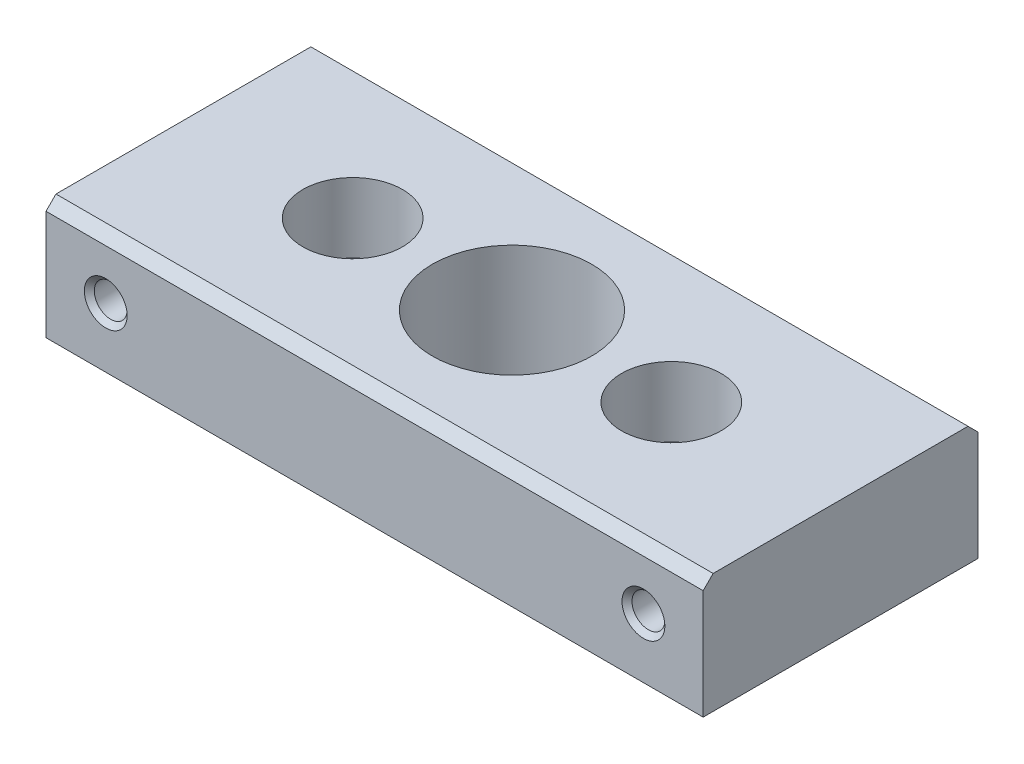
ISO-10303-21;
HEADER;
FILE_DESCRIPTION(('STEP AP214'),'2;1');
FILE_NAME('part.step','',(''),(''),'','','');
FILE_SCHEMA(('AUTOMOTIVE_DESIGN { 1 0 10303 214 1 1 1 1 }'));
ENDSEC;
DATA;
#1=APPLICATION_CONTEXT('core data for automotive mechanical design processes');
#2=APPLICATION_PROTOCOL_DEFINITION('international standard','automotive_design',2000,#1);
#3=PRODUCT_CONTEXT('',#1,'mechanical');
#4=PRODUCT('Part','Part','',(#3));
#5=PRODUCT_RELATED_PRODUCT_CATEGORY('part','',(#4));
#6=PRODUCT_DEFINITION_FORMATION('','',#4);
#7=PRODUCT_DEFINITION_CONTEXT('part definition',#1,'design');
#8=PRODUCT_DEFINITION('design','',#6,#7);
#9=PRODUCT_DEFINITION_SHAPE('','',#8);
#10=(LENGTH_UNIT() NAMED_UNIT(*) SI_UNIT(.MILLI.,.METRE.));
#11=(NAMED_UNIT(*) PLANE_ANGLE_UNIT() SI_UNIT($,.RADIAN.));
#12=(NAMED_UNIT(*) SI_UNIT($,.STERADIAN.) SOLID_ANGLE_UNIT());
#13=UNCERTAINTY_MEASURE_WITH_UNIT(LENGTH_MEASURE(1.E-05),#10,'distance_accuracy_value','');
#14=(GEOMETRIC_REPRESENTATION_CONTEXT(3) GLOBAL_UNCERTAINTY_ASSIGNED_CONTEXT((#13)) GLOBAL_UNIT_ASSIGNED_CONTEXT((#10,
#11,#12)) REPRESENTATION_CONTEXT('',''));
#15=CARTESIAN_POINT('',(0.,0.,0.));
#16=DIRECTION('',(0.,0.,1.));
#17=DIRECTION('',(1.,0.,0.));
#18=AXIS2_PLACEMENT_3D('',#15,#16,#17);
#19=CARTESIAN_POINT('',(16.0000000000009,-9.99200722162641E-13,-13.8000000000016));
#20=DIRECTION('',(0.,0.999999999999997,0.));
#21=DIRECTION('',(-1.,0.,0.));
#22=AXIS2_PLACEMENT_3D('',#19,#20,#21);
#23=CYLINDRICAL_SURFACE('',#22,3.);
#24=CARTESIAN_POINT('',(16.0000000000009,-9.99200722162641E-13,-13.8000000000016));
#25=DIRECTION('',(0.,0.999999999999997,0.));
#26=DIRECTION('',(-1.,0.,0.));
#27=AXIS2_PLACEMENT_3D('',#24,#25,#26);
#28=CIRCLE('',#27,3.);
#29=CARTESIAN_POINT('',(13.0000000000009,-9.99866855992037E-13,-13.8000000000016));
#30=VERTEX_POINT('',#29);
#31=EDGE_CURVE('E136',#30,#30,#28,.T.);
#32=CARTESIAN_POINT('',(16.0000000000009,4.99999999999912,-13.8000000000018));
#33=DIRECTION('',(0.,0.999999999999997,0.));
#34=DIRECTION('',(-1.,0.,0.));
#35=AXIS2_PLACEMENT_3D('',#32,#33,#34);
#36=CIRCLE('',#35,3.);
#37=CARTESIAN_POINT('',(13.0000000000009,4.99999999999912,-13.8000000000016));
#38=VERTEX_POINT('',#37);
#39=EDGE_CURVE('E138',#38,#38,#36,.F.);
#40=CARTESIAN_POINT('',(13.0000000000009,-9.99866855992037E-13,-13.8000000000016));
#41=CARTESIAN_POINT('',(13.0000000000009,0.0520833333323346,-13.8000000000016));
#42=CARTESIAN_POINT('',(13.0000000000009,0.104166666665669,-13.8000000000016));
#43=CARTESIAN_POINT('',(13.0000000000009,0.208333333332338,-13.8000000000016));
#44=CARTESIAN_POINT('',(13.0000000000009,0.260416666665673,-13.8000000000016));
#45=CARTESIAN_POINT('',(13.0000000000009,0.364583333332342,-13.8000000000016));
#46=CARTESIAN_POINT('',(13.0000000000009,0.416666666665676,-13.8000000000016));
#47=CARTESIAN_POINT('',(13.0000000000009,0.520833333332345,-13.8000000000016));
#48=CARTESIAN_POINT('',(13.0000000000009,0.57291666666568,-13.8000000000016));
#49=CARTESIAN_POINT('',(13.0000000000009,0.677083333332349,-13.8000000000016));
#50=CARTESIAN_POINT('',(13.0000000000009,0.729166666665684,-13.8000000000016));
#51=CARTESIAN_POINT('',(13.0000000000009,0.833333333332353,-13.8000000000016));
#52=CARTESIAN_POINT('',(13.0000000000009,0.885416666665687,-13.8000000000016));
#53=CARTESIAN_POINT('',(13.0000000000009,0.989583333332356,-13.8000000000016));
#54=CARTESIAN_POINT('',(13.0000000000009,1.04166666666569,-13.8000000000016));
#55=CARTESIAN_POINT('',(13.0000000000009,1.14583333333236,-13.8000000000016));
#56=CARTESIAN_POINT('',(13.0000000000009,1.19791666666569,-13.8000000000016));
#57=CARTESIAN_POINT('',(13.0000000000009,1.30208333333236,-13.8000000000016));
#58=CARTESIAN_POINT('',(13.0000000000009,1.3541666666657,-13.8000000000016));
#59=CARTESIAN_POINT('',(13.0000000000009,1.45833333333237,-13.8000000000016));
#60=CARTESIAN_POINT('',(13.0000000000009,1.5104166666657,-13.8000000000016));
#61=CARTESIAN_POINT('',(13.0000000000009,1.61458333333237,-13.8000000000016));
#62=CARTESIAN_POINT('',(13.0000000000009,1.66666666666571,-13.8000000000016));
#63=CARTESIAN_POINT('',(13.0000000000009,1.77083333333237,-13.8000000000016));
#64=CARTESIAN_POINT('',(13.0000000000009,1.82291666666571,-13.8000000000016));
#65=CARTESIAN_POINT('',(13.0000000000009,1.92708333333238,-13.8000000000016));
#66=CARTESIAN_POINT('',(13.0000000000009,1.97916666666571,-13.8000000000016));
#67=CARTESIAN_POINT('',(13.0000000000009,2.08333333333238,-13.8000000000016));
#68=CARTESIAN_POINT('',(13.0000000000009,2.13541666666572,-13.8000000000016));
#69=CARTESIAN_POINT('',(13.0000000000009,2.23958333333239,-13.8000000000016));
#70=CARTESIAN_POINT('',(13.0000000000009,2.29166666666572,-13.8000000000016));
#71=CARTESIAN_POINT('',(13.0000000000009,2.39583333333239,-13.8000000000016));
#72=CARTESIAN_POINT('',(13.0000000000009,2.44791666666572,-13.8000000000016));
#73=CARTESIAN_POINT('',(13.0000000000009,2.55208333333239,-13.8000000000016));
#74=CARTESIAN_POINT('',(13.0000000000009,2.60416666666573,-13.8000000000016));
#75=CARTESIAN_POINT('',(13.0000000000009,2.7083333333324,-13.8000000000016));
#76=CARTESIAN_POINT('',(13.0000000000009,2.76041666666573,-13.8000000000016));
#77=CARTESIAN_POINT('',(13.0000000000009,2.8645833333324,-13.8000000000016));
#78=CARTESIAN_POINT('',(13.0000000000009,2.91666666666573,-13.8000000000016));
#79=CARTESIAN_POINT('',(13.0000000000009,3.0208333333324,-13.8000000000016));
#80=CARTESIAN_POINT('',(13.0000000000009,3.07291666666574,-13.8000000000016));
#81=CARTESIAN_POINT('',(13.0000000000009,3.17708333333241,-13.8000000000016));
#82=CARTESIAN_POINT('',(13.0000000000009,3.22916666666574,-13.8000000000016));
#83=CARTESIAN_POINT('',(13.0000000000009,3.33333333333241,-13.8000000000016));
#84=CARTESIAN_POINT('',(13.0000000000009,3.38541666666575,-13.8000000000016));
#85=CARTESIAN_POINT('',(13.0000000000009,3.48958333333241,-13.8000000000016));
#86=CARTESIAN_POINT('',(13.0000000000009,3.54166666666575,-13.8000000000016));
#87=CARTESIAN_POINT('',(13.0000000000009,3.64583333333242,-13.8000000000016));
#88=CARTESIAN_POINT('',(13.0000000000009,3.69791666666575,-13.8000000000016));
#89=CARTESIAN_POINT('',(13.0000000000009,3.80208333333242,-13.8000000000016));
#90=CARTESIAN_POINT('',(13.0000000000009,3.85416666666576,-13.8000000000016));
#91=CARTESIAN_POINT('',(13.0000000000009,3.95833333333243,-13.8000000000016));
#92=CARTESIAN_POINT('',(13.0000000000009,4.01041666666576,-13.8000000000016));
#93=CARTESIAN_POINT('',(13.0000000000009,4.11458333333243,-13.8000000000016));
#94=CARTESIAN_POINT('',(13.0000000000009,4.16666666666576,-13.8000000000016));
#95=CARTESIAN_POINT('',(13.0000000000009,4.27083333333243,-13.8000000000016));
#96=CARTESIAN_POINT('',(13.0000000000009,4.32291666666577,-13.8000000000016));
#97=CARTESIAN_POINT('',(13.0000000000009,4.42708333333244,-13.8000000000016));
#98=CARTESIAN_POINT('',(13.0000000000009,4.47916666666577,-13.8000000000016));
#99=CARTESIAN_POINT('',(13.0000000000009,4.58333333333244,-13.8000000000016));
#100=CARTESIAN_POINT('',(13.0000000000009,4.63541666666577,-13.8000000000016));
#101=CARTESIAN_POINT('',(13.0000000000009,4.73958333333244,-13.8000000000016));
#102=CARTESIAN_POINT('',(13.0000000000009,4.79166666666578,-13.8000000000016));
#103=CARTESIAN_POINT('',(13.0000000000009,4.89583333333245,-13.8000000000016));
#104=CARTESIAN_POINT('',(13.0000000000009,4.94791666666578,-13.8000000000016));
#105=CARTESIAN_POINT('',(13.0000000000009,4.99999999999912,-13.8000000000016));
#106=B_SPLINE_CURVE_WITH_KNOTS('',3,(#40,#41,#42,#43,#44,#45,#46,#47,#48,#49,#50,#51,#52,#53,
#54,#55,#56,#57,#58,#59,#60,#61,#62,#63,#64,#65,#66,#67,#68,#69,#70,#71,#72,#73,#74,#75,#76,#77,
#78,#79,#80,#81,#82,#83,#84,#85,#86,#87,#88,#89,#90,#91,#92,#93,#94,#95,#96,#97,#98,#99,#100,
#101,#102,#103,#104,#105),.UNSPECIFIED.,.F.,.F.,(4,2,2,2,2,2,2,2,2,2,2,2,2,2,2,2,2,2,2,2,2,2,2,
2,2,2,2,2,2,2,2,2,4),(0.,0.156250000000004,0.312500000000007,0.468750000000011,
0.625000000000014,0.781250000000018,0.937500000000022,1.09375000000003,1.25000000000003,
1.40625000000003,1.56250000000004,1.71875000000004,1.87500000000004,2.03125000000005,
2.18750000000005,2.34375000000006,2.50000000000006,2.65625000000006,2.81250000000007,
2.96875000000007,3.12500000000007,3.28125000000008,3.43750000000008,3.59375000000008,
3.75000000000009,3.90625000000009,4.06250000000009,4.2187500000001,4.3750000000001,
4.5312500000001,4.68750000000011,4.84375000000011,5.00000000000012),.UNSPECIFIED.);
#107=EDGE_CURVE('BSEAM40',#30,#38,#106,.T.);
#108=ORIENTED_EDGE('',*,*,#31,.F.);
#109=ORIENTED_EDGE('',*,*,#39,.F.);
#110=ORIENTED_EDGE('',*,*,#107,.T.);
#111=ORIENTED_EDGE('',*,*,#107,.F.);
#112=EDGE_LOOP('',(#108,#110,#109,#111));
#113=FACE_BOUND('',#112,.T.);
#114=ADVANCED_FACE('F40',(#113),#23,.F.);
#115=CARTESIAN_POINT('',(-16.,0.,-13.8));
#116=DIRECTION('',(0.,0.999999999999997,0.));
#117=DIRECTION('',(-1.,0.,0.));
#118=AXIS2_PLACEMENT_3D('',#115,#116,#117);
#119=CYLINDRICAL_SURFACE('',#118,3.);
#120=CARTESIAN_POINT('',(-16.,0.,-13.8));
#121=DIRECTION('',(0.,0.999999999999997,0.));
#122=DIRECTION('',(-1.,0.,0.));
#123=AXIS2_PLACEMENT_3D('',#120,#121,#122);
#124=CIRCLE('',#123,3.);
#125=CARTESIAN_POINT('',(-19.,0.,-13.8));
#126=VERTEX_POINT('',#125);
#127=EDGE_CURVE('E285',#126,#126,#124,.T.);
#128=CARTESIAN_POINT('',(-16.,4.99999999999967,-13.800000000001));
#129=DIRECTION('',(0.,0.999999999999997,0.));
#130=DIRECTION('',(-1.,0.,0.));
#131=AXIS2_PLACEMENT_3D('',#128,#129,#130);
#132=CIRCLE('',#131,3.);
#133=CARTESIAN_POINT('',(-19.,4.99999999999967,-13.8));
#134=VERTEX_POINT('',#133);
#135=EDGE_CURVE('E133',#134,#134,#132,.F.);
#136=CARTESIAN_POINT('',(-19.,0.,-13.8));
#137=CARTESIAN_POINT('',(-19.,0.0520833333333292,-13.8));
#138=CARTESIAN_POINT('',(-19.,0.104166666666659,-13.8));
#139=CARTESIAN_POINT('',(-19.,0.208333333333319,-13.8));
#140=CARTESIAN_POINT('',(-19.,0.260416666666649,-13.8));
#141=CARTESIAN_POINT('',(-19.,0.364583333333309,-13.8));
#142=CARTESIAN_POINT('',(-19.,0.416666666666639,-13.8));
#143=CARTESIAN_POINT('',(-19.,0.520833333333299,-13.8));
#144=CARTESIAN_POINT('',(-19.,0.572916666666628,-13.8));
#145=CARTESIAN_POINT('',(-19.,0.677083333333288,-13.8));
#146=CARTESIAN_POINT('',(-19.,0.729166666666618,-13.8));
#147=CARTESIAN_POINT('',(-19.,0.833333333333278,-13.8));
#148=CARTESIAN_POINT('',(-19.,0.885416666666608,-13.8));
#149=CARTESIAN_POINT('',(-19.,0.989583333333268,-13.8));
#150=CARTESIAN_POINT('',(-19.,1.0416666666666,-13.8));
#151=CARTESIAN_POINT('',(-19.,1.14583333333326,-13.8));
#152=CARTESIAN_POINT('',(-19.,1.19791666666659,-13.8));
#153=CARTESIAN_POINT('',(-19.,1.30208333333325,-13.8));
#154=CARTESIAN_POINT('',(-19.,1.35416666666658,-13.8));
#155=CARTESIAN_POINT('',(-19.,1.45833333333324,-13.8));
#156=CARTESIAN_POINT('',(-19.,1.51041666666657,-13.8));
#157=CARTESIAN_POINT('',(-19.,1.61458333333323,-13.8));
#158=CARTESIAN_POINT('',(-19.,1.66666666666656,-13.8));
#159=CARTESIAN_POINT('',(-19.,1.77083333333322,-13.8));
#160=CARTESIAN_POINT('',(-19.,1.82291666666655,-13.8));
#161=CARTESIAN_POINT('',(-19.,1.92708333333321,-13.8));
#162=CARTESIAN_POINT('',(-19.,1.97916666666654,-13.8));
#163=CARTESIAN_POINT('',(-19.,2.0833333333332,-13.8));
#164=CARTESIAN_POINT('',(-19.,2.13541666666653,-13.8));
#165=CARTESIAN_POINT('',(-19.,2.23958333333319,-13.8));
#166=CARTESIAN_POINT('',(-19.,2.29166666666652,-13.8));
#167=CARTESIAN_POINT('',(-19.,2.39583333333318,-13.8));
#168=CARTESIAN_POINT('',(-19.,2.44791666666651,-13.8));
#169=CARTESIAN_POINT('',(-19.,2.55208333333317,-13.8));
#170=CARTESIAN_POINT('',(-19.,2.6041666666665,-13.8));
#171=CARTESIAN_POINT('',(-19.,2.70833333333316,-13.8));
#172=CARTESIAN_POINT('',(-19.,2.76041666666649,-13.8));
#173=CARTESIAN_POINT('',(-19.,2.86458333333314,-13.8));
#174=CARTESIAN_POINT('',(-19.,2.91666666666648,-13.8));
#175=CARTESIAN_POINT('',(-19.,3.02083333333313,-13.8));
#176=CARTESIAN_POINT('',(-19.,3.07291666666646,-13.8));
#177=CARTESIAN_POINT('',(-19.,3.17708333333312,-13.8));
#178=CARTESIAN_POINT('',(-19.,3.22916666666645,-13.8));
#179=CARTESIAN_POINT('',(-19.,3.33333333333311,-13.8));
#180=CARTESIAN_POINT('',(-19.,3.38541666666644,-13.8));
#181=CARTESIAN_POINT('',(-19.,3.4895833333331,-13.8));
#182=CARTESIAN_POINT('',(-19.,3.54166666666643,-13.8));
#183=CARTESIAN_POINT('',(-19.,3.64583333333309,-13.8));
#184=CARTESIAN_POINT('',(-19.,3.69791666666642,-13.8));
#185=CARTESIAN_POINT('',(-19.,3.80208333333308,-13.8));
#186=CARTESIAN_POINT('',(-19.,3.85416666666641,-13.8));
#187=CARTESIAN_POINT('',(-19.,3.95833333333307,-13.8));
#188=CARTESIAN_POINT('',(-19.,4.0104166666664,-13.8));
#189=CARTESIAN_POINT('',(-19.,4.11458333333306,-13.8));
#190=CARTESIAN_POINT('',(-19.,4.16666666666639,-13.8));
#191=CARTESIAN_POINT('',(-19.,4.27083333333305,-13.8));
#192=CARTESIAN_POINT('',(-19.,4.32291666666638,-13.8));
#193=CARTESIAN_POINT('',(-19.,4.42708333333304,-13.8));
#194=CARTESIAN_POINT('',(-19.,4.47916666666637,-13.8));
#195=CARTESIAN_POINT('',(-19.,4.58333333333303,-13.8));
#196=CARTESIAN_POINT('',(-19.,4.63541666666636,-13.8));
#197=CARTESIAN_POINT('',(-19.,4.73958333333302,-13.8));
#198=CARTESIAN_POINT('',(-19.,4.79166666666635,-13.8));
#199=CARTESIAN_POINT('',(-19.,4.89583333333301,-13.8));
#200=CARTESIAN_POINT('',(-19.,4.94791666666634,-13.8));
#201=CARTESIAN_POINT('',(-19.,4.99999999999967,-13.8));
#202=B_SPLINE_CURVE_WITH_KNOTS('',3,(#136,#137,#138,#139,#140,#141,#142,#143,#144,#145,#146,
#147,#148,#149,#150,#151,#152,#153,#154,#155,#156,#157,#158,#159,#160,#161,#162,#163,#164,#165,
#166,#167,#168,#169,#170,#171,#172,#173,#174,#175,#176,#177,#178,#179,#180,#181,#182,#183,#184,
#185,#186,#187,#188,#189,#190,#191,#192,#193,#194,#195,#196,#197,#198,#199,#200,#201),
.UNSPECIFIED.,.F.,.F.,(4,2,2,2,2,2,2,2,2,2,2,2,2,2,2,2,2,2,2,2,2,2,2,2,2,2,2,2,2,2,2,2,4),(0.,
0.15624999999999,0.31249999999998,0.468749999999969,0.624999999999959,0.781249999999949,
0.937499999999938,1.09374999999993,1.24999999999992,1.40624999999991,1.5624999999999,
1.71874999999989,1.87499999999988,2.03124999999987,2.18749999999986,2.34374999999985,
2.49999999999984,2.65624999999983,2.81249999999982,2.96874999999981,3.1249999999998,
3.28124999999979,3.43749999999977,3.59374999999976,3.74999999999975,3.90624999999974,
4.06249999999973,4.21874999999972,4.37499999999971,4.5312499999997,4.68749999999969,
4.84374999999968,4.99999999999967),.UNSPECIFIED.);
#203=EDGE_CURVE('BSEAM195',#126,#134,#202,.T.);
#204=ORIENTED_EDGE('',*,*,#127,.F.);
#205=ORIENTED_EDGE('',*,*,#135,.F.);
#206=ORIENTED_EDGE('',*,*,#203,.T.);
#207=ORIENTED_EDGE('',*,*,#203,.F.);
#208=EDGE_LOOP('',(#204,#206,#205,#207));
#209=FACE_BOUND('',#208,.T.);
#210=ADVANCED_FACE('F195',(#209),#119,.F.);
#211=CARTESIAN_POINT('',(-32.9999999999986,0.,-27.6000000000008));
#212=DIRECTION('',(-1.,0.,0.));
#213=DIRECTION('',(0.,0.,1.));
#214=AXIS2_PLACEMENT_3D('',#211,#212,#213);
#215=PLANE('',#214);
#216=DIRECTION('',(0.,0.,1.));
#217=VECTOR('',#216,1.);
#218=CARTESIAN_POINT('',(-32.9999999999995,11.9999999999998,-27.6000000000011));
#219=LINE('',#218,#217);
#220=CARTESIAN_POINT('',(-32.9999999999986,11.9999999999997,-26.6000000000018));
#221=VERTEX_POINT('',#220);
#222=CARTESIAN_POINT('',(-33.0000000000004,11.9999999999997,-1.00000000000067));
#223=VERTEX_POINT('',#222);
#224=EDGE_CURVE('E126',#221,#223,#219,.T.);
#225=ORIENTED_EDGE('',*,*,#224,.F.);
#226=DIRECTION('',(0.,0.707106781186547,0.707106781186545));
#227=VECTOR('',#226,1.);
#228=CARTESIAN_POINT('',(-33.0000000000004,5.49999999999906,-33.1000000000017));
#229=LINE('',#228,#227);
#230=CARTESIAN_POINT('',(-32.9999999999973,10.9999999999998,-27.6000000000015));
#231=VERTEX_POINT('',#230);
#232=EDGE_CURVE('E103',#221,#231,#229,.F.);
#233=ORIENTED_EDGE('',*,*,#232,.T.);
#234=DIRECTION('',(0.,-0.999999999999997,0.));
#235=VECTOR('',#234,1.);
#236=CARTESIAN_POINT('',(-32.9999999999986,0.,-27.6000000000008));
#237=LINE('',#236,#235);
#238=CARTESIAN_POINT('',(-32.9999999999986,0.,-27.6000000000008));
#239=VERTEX_POINT('',#238);
#240=EDGE_CURVE('E96',#231,#239,#237,.T.);
#241=ORIENTED_EDGE('',*,*,#240,.T.);
#242=DIRECTION('',(0.,0.,1.));
#243=VECTOR('',#242,1.);
#244=CARTESIAN_POINT('',(-32.9999999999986,0.,-27.6000000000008));
#245=LINE('',#244,#243);
#246=CARTESIAN_POINT('',(-32.9999999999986,4.44089209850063E-13,-2.1094237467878E-12));
#247=VERTEX_POINT('',#246);
#248=EDGE_CURVE('E101',#239,#247,#245,.T.);
#249=ORIENTED_EDGE('',*,*,#248,.T.);
#250=DIRECTION('',(0.,-0.999999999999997,0.));
#251=VECTOR('',#250,1.);
#252=CARTESIAN_POINT('',(-32.9999999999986,4.44089209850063E-13,-2.1094237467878E-12));
#253=LINE('',#252,#251);
#254=CARTESIAN_POINT('',(-32.9999999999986,11.,-1.66533453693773E-12));
#255=VERTEX_POINT('',#254);
#256=EDGE_CURVE('E121',#255,#247,#253,.T.);
#257=ORIENTED_EDGE('',*,*,#256,.F.);
#258=DIRECTION('',(0.,0.707106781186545,-0.707106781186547));
#259=VECTOR('',#258,1.);
#260=CARTESIAN_POINT('',(-32.9999999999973,19.2999999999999,-8.30000000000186));
#261=LINE('',#260,#259);
#262=EDGE_CURVE('E171',#255,#223,#261,.T.);
#263=ORIENTED_EDGE('',*,*,#262,.T.);
#264=EDGE_LOOP('',(#225,#233,#241,#249,#257,#263));
#265=FACE_BOUND('',#264,.T.);
#266=ADVANCED_FACE('F99',(#265),#215,.T.);
#267=CARTESIAN_POINT('',(-32.9999999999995,11.9999999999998,-27.6000000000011));
#268=DIRECTION('',(0.,0.999999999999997,0.));
#269=DIRECTION('',(-1.,0.,0.));
#270=AXIS2_PLACEMENT_3D('',#267,#268,#269);
#271=PLANE('',#270);
#272=CARTESIAN_POINT('',(16.0000000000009,11.9999999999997,-13.8000000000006));
#273=DIRECTION('',(0.,0.999999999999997,0.));
#274=DIRECTION('',(-1.,0.,0.));
#275=AXIS2_PLACEMENT_3D('',#272,#273,#274);
#276=CIRCLE('',#275,5.);
#277=CARTESIAN_POINT('',(11.0000000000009,11.9999999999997,-13.8000000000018));
#278=VERTEX_POINT('',#277);
#279=EDGE_CURVE('E280',#278,#278,#276,.T.);
#280=ORIENTED_EDGE('',*,*,#279,.F.);
#281=EDGE_LOOP('',(#280));
#282=FACE_BOUND('',#281,.T.);
#283=CARTESIAN_POINT('',(-15.9999999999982,12.0000000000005,-13.8000000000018));
#284=DIRECTION('',(0.,0.999999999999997,0.));
#285=DIRECTION('',(-1.,0.,0.));
#286=AXIS2_PLACEMENT_3D('',#283,#284,#285);
#287=CIRCLE('',#286,5.);
#288=CARTESIAN_POINT('',(-21.,12.0000000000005,-13.800000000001));
#289=VERTEX_POINT('',#288);
#290=EDGE_CURVE('E141',#289,#289,#287,.T.);
#291=ORIENTED_EDGE('',*,*,#290,.F.);
#292=EDGE_LOOP('',(#291));
#293=FACE_BOUND('',#292,.T.);
#294=CARTESIAN_POINT('',(8.88178419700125E-13,11.9999999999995,-13.800000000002));
#295=DIRECTION('',(0.,0.999999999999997,0.));
#296=DIRECTION('',(-1.,0.,0.));
#297=AXIS2_PLACEMENT_3D('',#294,#295,#296);
#298=CIRCLE('',#297,8.);
#299=CARTESIAN_POINT('',(-8.00000000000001,11.9999999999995,-13.8000000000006));
#300=VERTEX_POINT('',#299);
#301=EDGE_CURVE('E288',#300,#300,#298,.T.);
#302=ORIENTED_EDGE('',*,*,#301,.F.);
#303=EDGE_LOOP('',(#302));
#304=FACE_BOUND('',#303,.T.);
#305=DIRECTION('',(0.,0.,1.));
#306=VECTOR('',#305,1.);
#307=CARTESIAN_POINT('',(33.0000000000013,11.999999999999,-27.600000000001));
#308=LINE('',#307,#306);
#309=CARTESIAN_POINT('',(33.0000000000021,11.9999999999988,-26.6000000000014));
#310=VERTEX_POINT('',#309);
#311=CARTESIAN_POINT('',(33.0000000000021,11.9999999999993,-1.00000000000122));
#312=VERTEX_POINT('',#311);
#313=EDGE_CURVE('E130',#310,#312,#308,.T.);
#314=ORIENTED_EDGE('',*,*,#313,.F.);
#315=DIRECTION('',(-1.,0.,0.));
#316=VECTOR('',#315,1.);
#317=CARTESIAN_POINT('',(-32.9999999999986,11.9999999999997,-26.6000000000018));
#318=LINE('',#317,#316);
#319=EDGE_CURVE('E168',#310,#221,#318,.T.);
#320=ORIENTED_EDGE('',*,*,#319,.T.);
#321=ORIENTED_EDGE('',*,*,#224,.T.);
#322=DIRECTION('',(1.,0.,0.));
#323=VECTOR('',#322,1.);
#324=CARTESIAN_POINT('',(33.0000000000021,11.9999999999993,-1.00000000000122));
#325=LINE('',#324,#323);
#326=EDGE_CURVE('E166',#223,#312,#325,.T.);
#327=ORIENTED_EDGE('',*,*,#326,.T.);
#328=EDGE_LOOP('',(#314,#320,#321,#327));
#329=FACE_BOUND('',#328,.T.);
#330=ADVANCED_FACE('F181',(#282,#293,#304,#329),#271,.T.);
#331=CARTESIAN_POINT('',(33.0000000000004,1.11022302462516E-13,-27.600000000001));
#332=DIRECTION('',(1.,0.,0.));
#333=DIRECTION('',(0.,0.,-1.));
#334=AXIS2_PLACEMENT_3D('',#331,#332,#333);
#335=PLANE('',#334);
#336=DIRECTION('',(0.,0.999999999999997,0.));
#337=VECTOR('',#336,1.);
#338=CARTESIAN_POINT('',(33.0000000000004,1.11022302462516E-13,-27.600000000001));
#339=LINE('',#338,#337);
#340=CARTESIAN_POINT('',(33.0000000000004,1.11022302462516E-13,-27.600000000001));
#341=VERTEX_POINT('',#340);
#342=CARTESIAN_POINT('',(33.0000000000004,10.9999999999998,-27.6000000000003));
#343=VERTEX_POINT('',#342);
#344=EDGE_CURVE('E114',#341,#343,#339,.T.);
#345=ORIENTED_EDGE('',*,*,#344,.T.);
#346=DIRECTION('',(0.,-0.707106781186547,-0.707106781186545));
#347=VECTOR('',#346,1.);
#348=CARTESIAN_POINT('',(33.0000000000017,5.50000000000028,-33.100000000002));
#349=LINE('',#348,#347);
#350=EDGE_CURVE('E48',#343,#310,#349,.F.);
#351=ORIENTED_EDGE('',*,*,#350,.T.);
#352=ORIENTED_EDGE('',*,*,#313,.T.);
#353=DIRECTION('',(0.,-0.707106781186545,0.707106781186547));
#354=VECTOR('',#353,1.);
#355=CARTESIAN_POINT('',(33.0000000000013,19.2999999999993,-8.30000000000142));
#356=LINE('',#355,#354);
#357=CARTESIAN_POINT('',(33.0000000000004,10.9999999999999,-2.22044604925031E-13));
#358=VERTEX_POINT('',#357);
#359=EDGE_CURVE('E55',#312,#358,#356,.T.);
#360=ORIENTED_EDGE('',*,*,#359,.T.);
#361=DIRECTION('',(0.,0.999999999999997,0.));
#362=VECTOR('',#361,1.);
#363=CARTESIAN_POINT('',(33.0000000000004,0.,-2.22044604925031E-13));
#364=LINE('',#363,#362);
#365=CARTESIAN_POINT('',(33.0000000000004,0.,-2.22044604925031E-13));
#366=VERTEX_POINT('',#365);
#367=EDGE_CURVE('E106',#366,#358,#364,.T.);
#368=ORIENTED_EDGE('',*,*,#367,.F.);
#369=DIRECTION('',(0.,0.,1.));
#370=VECTOR('',#369,1.);
#371=CARTESIAN_POINT('',(33.0000000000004,1.11022302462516E-13,-27.600000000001));
#372=LINE('',#371,#370);
#373=EDGE_CURVE('E113',#341,#366,#372,.T.);
#374=ORIENTED_EDGE('',*,*,#373,.F.);
#375=EDGE_LOOP('',(#345,#351,#352,#360,#368,#374));
#376=FACE_BOUND('',#375,.T.);
#377=ADVANCED_FACE('F177',(#376),#335,.T.);
#378=CARTESIAN_POINT('',(-32.9999999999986,0.,-27.6000000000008));
#379=DIRECTION('',(0.,-0.999999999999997,0.));
#380=DIRECTION('',(1.,0.,0.));
#381=AXIS2_PLACEMENT_3D('',#378,#379,#380);
#382=PLANE('',#381);
#383=ORIENTED_EDGE('',*,*,#31,.T.);
#384=EDGE_LOOP('',(#383));
#385=FACE_BOUND('',#384,.T.);
#386=ORIENTED_EDGE('',*,*,#127,.T.);
#387=EDGE_LOOP('',(#386));
#388=FACE_BOUND('',#387,.T.);
#389=CARTESIAN_POINT('',(0.,-1.11022302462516E-13,-13.8000000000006));
#390=DIRECTION('',(0.,0.999999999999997,0.));
#391=DIRECTION('',(-1.,0.,0.));
#392=AXIS2_PLACEMENT_3D('',#389,#390,#391);
#393=CIRCLE('',#392,8.);
#394=CARTESIAN_POINT('',(-8.00000000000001,-1.12798659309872E-13,-13.8000000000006));
#395=VERTEX_POINT('',#394);
#396=EDGE_CURVE('E123',#395,#395,#393,.T.);
#397=ORIENTED_EDGE('',*,*,#396,.T.);
#398=EDGE_LOOP('',(#397));
#399=FACE_BOUND('',#398,.T.);
#400=DIRECTION('',(1.,0.,0.));
#401=VECTOR('',#400,1.);
#402=CARTESIAN_POINT('',(-32.9999999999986,4.44089209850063E-13,-2.1094237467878E-12));
#403=LINE('',#402,#401);
#404=EDGE_CURVE('E112',#247,#366,#403,.T.);
#405=ORIENTED_EDGE('',*,*,#404,.F.);
#406=ORIENTED_EDGE('',*,*,#248,.F.);
#407=DIRECTION('',(1.,0.,0.));
#408=VECTOR('',#407,1.);
#409=CARTESIAN_POINT('',(-32.9999999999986,0.,-27.6000000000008));
#410=LINE('',#409,#408);
#411=EDGE_CURVE('E105',#239,#341,#410,.T.);
#412=ORIENTED_EDGE('',*,*,#411,.T.);
#413=ORIENTED_EDGE('',*,*,#373,.T.);
#414=EDGE_LOOP('',(#405,#406,#412,#413));
#415=FACE_BOUND('',#414,.T.);
#416=ADVANCED_FACE('F110',(#385,#388,#399,#415),#382,.T.);
#417=CARTESIAN_POINT('',(0.,0.,-27.6000000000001));
#418=DIRECTION('',(0.,0.,-1.));
#419=DIRECTION('',(-1.,0.,0.));
#420=AXIS2_PLACEMENT_3D('',#417,#418,#419);
#421=PLANE('',#420);
#422=CARTESIAN_POINT('',(-26.9999999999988,5.99999999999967,-27.6000000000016));
#423=DIRECTION('',(0.,0.,-1.));
#424=DIRECTION('',(-1.,0.,0.));
#425=AXIS2_PLACEMENT_3D('',#422,#423,#424);
#426=CIRCLE('',#425,2.14999999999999);
#427=CARTESIAN_POINT('',(-29.1499999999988,5.99999999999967,-27.6000000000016));
#428=VERTEX_POINT('',#427);
#429=EDGE_CURVE('E163',#428,#428,#426,.F.);
#430=ORIENTED_EDGE('',*,*,#429,.T.);
#431=EDGE_LOOP('',(#430));
#432=FACE_BOUND('',#431,.T.);
#433=CARTESIAN_POINT('',(27.0000000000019,6.00000000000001,-27.6000000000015));
#434=DIRECTION('',(0.,0.,-1.));
#435=DIRECTION('',(-1.,0.,0.));
#436=AXIS2_PLACEMENT_3D('',#433,#434,#435);
#437=CIRCLE('',#436,2.14999999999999);
#438=CARTESIAN_POINT('',(24.8500000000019,6.00000000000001,-27.6000000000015));
#439=VERTEX_POINT('',#438);
#440=EDGE_CURVE('E160',#439,#439,#437,.F.);
#441=ORIENTED_EDGE('',*,*,#440,.T.);
#442=EDGE_LOOP('',(#441));
#443=FACE_BOUND('',#442,.T.);
#444=ORIENTED_EDGE('',*,*,#240,.F.);
#445=DIRECTION('',(1.,0.,0.));
#446=VECTOR('',#445,1.);
#447=CARTESIAN_POINT('',(0.,10.9999999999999,-27.6000000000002));
#448=LINE('',#447,#446);
#449=EDGE_CURVE('E63',#231,#343,#448,.T.);
#450=ORIENTED_EDGE('',*,*,#449,.T.);
#451=ORIENTED_EDGE('',*,*,#344,.F.);
#452=ORIENTED_EDGE('',*,*,#411,.F.);
#453=EDGE_LOOP('',(#444,#450,#451,#452));
#454=FACE_BOUND('',#453,.T.);
#455=ADVANCED_FACE('F116',(#432,#443,#454),#421,.T.);
#456=CARTESIAN_POINT('',(0.,0.,0.));
#457=DIRECTION('',(0.,0.,-1.));
#458=DIRECTION('',(-1.,0.,0.));
#459=AXIS2_PLACEMENT_3D('',#456,#457,#458);
#460=PLANE('',#459);
#461=CARTESIAN_POINT('',(27.0000000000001,5.99999999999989,-4.44089209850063E-13));
#462=DIRECTION('',(0.,0.,-1.));
#463=DIRECTION('',(-1.,0.,0.));
#464=AXIS2_PLACEMENT_3D('',#461,#462,#463);
#465=CIRCLE('',#464,2.15000000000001);
#466=CARTESIAN_POINT('',(24.8500000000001,5.99999999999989,-4.44685954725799E-13));
#467=VERTEX_POINT('',#466);
#468=EDGE_CURVE('E151',#467,#467,#465,.T.);
#469=ORIENTED_EDGE('',*,*,#468,.T.);
#470=EDGE_LOOP('',(#469));
#471=FACE_BOUND('',#470,.T.);
#472=CARTESIAN_POINT('',(-27.0000000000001,6.00000000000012,-5.55111512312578E-13));
#473=DIRECTION('',(0.,0.,-1.));
#474=DIRECTION('',(-1.,0.,0.));
#475=AXIS2_PLACEMENT_3D('',#472,#473,#474);
#476=CIRCLE('',#475,2.15000000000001);
#477=CARTESIAN_POINT('',(-29.1500000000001,6.00000000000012,-5.55708257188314E-13));
#478=VERTEX_POINT('',#477);
#479=EDGE_CURVE('E148',#478,#478,#476,.T.);
#480=ORIENTED_EDGE('',*,*,#479,.T.);
#481=EDGE_LOOP('',(#480));
#482=FACE_BOUND('',#481,.T.);
#483=ORIENTED_EDGE('',*,*,#367,.T.);
#484=DIRECTION('',(-1.,0.,0.));
#485=VECTOR('',#484,1.);
#486=CARTESIAN_POINT('',(-32.9999999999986,11.,-1.66533453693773E-12));
#487=LINE('',#486,#485);
#488=EDGE_CURVE('E11',#358,#255,#487,.T.);
#489=ORIENTED_EDGE('',*,*,#488,.T.);
#490=ORIENTED_EDGE('',*,*,#256,.T.);
#491=ORIENTED_EDGE('',*,*,#404,.T.);
#492=EDGE_LOOP('',(#483,#489,#490,#491));
#493=FACE_BOUND('',#492,.T.);
#494=ADVANCED_FACE('F213',(#471,#482,#493),#460,.F.);
#495=CARTESIAN_POINT('',(0.,-1.11022302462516E-13,-13.8000000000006));
#496=DIRECTION('',(0.,0.999999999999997,0.));
#497=DIRECTION('',(-1.,0.,0.));
#498=AXIS2_PLACEMENT_3D('',#495,#496,#497);
#499=CYLINDRICAL_SURFACE('',#498,8.);
#500=CARTESIAN_POINT('',(-8.00000000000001,-1.12798659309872E-13,-13.8000000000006));
#501=CARTESIAN_POINT('',(-8.00000000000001,0.124999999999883,-13.8000000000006));
#502=CARTESIAN_POINT('',(-8.00000000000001,0.249999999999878,-13.8000000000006));
#503=CARTESIAN_POINT('',(-8.00000000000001,0.499999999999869,-13.8000000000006));
#504=CARTESIAN_POINT('',(-8.00000000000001,0.624999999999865,-13.8000000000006));
#505=CARTESIAN_POINT('',(-8.00000000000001,0.874999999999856,-13.8000000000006));
#506=CARTESIAN_POINT('',(-8.00000000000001,0.999999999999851,-13.8000000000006));
#507=CARTESIAN_POINT('',(-8.00000000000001,1.24999999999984,-13.8000000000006));
#508=CARTESIAN_POINT('',(-8.00000000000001,1.37499999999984,-13.8000000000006));
#509=CARTESIAN_POINT('',(-8.00000000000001,1.62499999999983,-13.8000000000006));
#510=CARTESIAN_POINT('',(-8.00000000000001,1.74999999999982,-13.8000000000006));
#511=CARTESIAN_POINT('',(-8.00000000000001,1.99999999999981,-13.8000000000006));
#512=CARTESIAN_POINT('',(-8.00000000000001,2.12499999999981,-13.8000000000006));
#513=CARTESIAN_POINT('',(-8.00000000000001,2.3749999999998,-13.8000000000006));
#514=CARTESIAN_POINT('',(-8.00000000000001,2.4999999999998,-13.8000000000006));
#515=CARTESIAN_POINT('',(-8.00000000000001,2.74999999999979,-13.8000000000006));
#516=CARTESIAN_POINT('',(-8.00000000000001,2.87499999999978,-13.8000000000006));
#517=CARTESIAN_POINT('',(-8.00000000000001,3.12499999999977,-13.8000000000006));
#518=CARTESIAN_POINT('',(-8.00000000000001,3.24999999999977,-13.8000000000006));
#519=CARTESIAN_POINT('',(-8.00000000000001,3.49999999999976,-13.8000000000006));
#520=CARTESIAN_POINT('',(-8.00000000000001,3.62499999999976,-13.8000000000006));
#521=CARTESIAN_POINT('',(-8.00000000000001,3.87499999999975,-13.8000000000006));
#522=CARTESIAN_POINT('',(-8.00000000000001,3.99999999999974,-13.8000000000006));
#523=CARTESIAN_POINT('',(-8.00000000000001,4.24999999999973,-13.8000000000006));
#524=CARTESIAN_POINT('',(-8.00000000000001,4.37499999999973,-13.8000000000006));
#525=CARTESIAN_POINT('',(-8.00000000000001,4.62499999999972,-13.8000000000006));
#526=CARTESIAN_POINT('',(-8.00000000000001,4.74999999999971,-13.8000000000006));
#527=CARTESIAN_POINT('',(-8.00000000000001,4.99999999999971,-13.8000000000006));
#528=CARTESIAN_POINT('',(-8.00000000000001,5.1249999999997,-13.8000000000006));
#529=CARTESIAN_POINT('',(-8.00000000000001,5.37499999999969,-13.8000000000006));
#530=CARTESIAN_POINT('',(-8.00000000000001,5.49999999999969,-13.8000000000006));
#531=CARTESIAN_POINT('',(-8.00000000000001,5.74999999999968,-13.8000000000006));
#532=CARTESIAN_POINT('',(-8.00000000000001,5.87499999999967,-13.8000000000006));
#533=CARTESIAN_POINT('',(-8.00000000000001,6.12499999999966,-13.8000000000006));
#534=CARTESIAN_POINT('',(-8.00000000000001,6.24999999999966,-13.8000000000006));
#535=CARTESIAN_POINT('',(-8.00000000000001,6.49999999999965,-13.8000000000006));
#536=CARTESIAN_POINT('',(-8.00000000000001,6.62499999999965,-13.8000000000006));
#537=CARTESIAN_POINT('',(-8.00000000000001,6.87499999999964,-13.8000000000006));
#538=CARTESIAN_POINT('',(-8.00000000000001,6.99999999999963,-13.8000000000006));
#539=CARTESIAN_POINT('',(-8.00000000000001,7.24999999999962,-13.8000000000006));
#540=CARTESIAN_POINT('',(-8.00000000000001,7.37499999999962,-13.8000000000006));
#541=CARTESIAN_POINT('',(-8.00000000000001,7.62499999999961,-13.8000000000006));
#542=CARTESIAN_POINT('',(-8.00000000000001,7.74999999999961,-13.8000000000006));
#543=CARTESIAN_POINT('',(-8.00000000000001,7.9999999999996,-13.8000000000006));
#544=CARTESIAN_POINT('',(-8.00000000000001,8.12499999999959,-13.8000000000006));
#545=CARTESIAN_POINT('',(-8.00000000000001,8.37499999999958,-13.8000000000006));
#546=CARTESIAN_POINT('',(-8.00000000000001,8.49999999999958,-13.8000000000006));
#547=CARTESIAN_POINT('',(-8.00000000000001,8.74999999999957,-13.8000000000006));
#548=CARTESIAN_POINT('',(-8.00000000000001,8.87499999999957,-13.8000000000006));
#549=CARTESIAN_POINT('',(-8.00000000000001,9.12499999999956,-13.8000000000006));
#550=CARTESIAN_POINT('',(-8.00000000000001,9.24999999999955,-13.8000000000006));
#551=CARTESIAN_POINT('',(-8.00000000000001,9.49999999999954,-13.8000000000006));
#552=CARTESIAN_POINT('',(-8.00000000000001,9.62499999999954,-13.8000000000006));
#553=CARTESIAN_POINT('',(-8.00000000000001,9.87499999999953,-13.8000000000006));
#554=CARTESIAN_POINT('',(-8.00000000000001,9.99999999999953,-13.8000000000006));
#555=CARTESIAN_POINT('',(-8.00000000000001,10.2499999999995,-13.8000000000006));
#556=CARTESIAN_POINT('',(-8.00000000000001,10.3749999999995,-13.8000000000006));
#557=CARTESIAN_POINT('',(-8.00000000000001,10.6249999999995,-13.8000000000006));
#558=CARTESIAN_POINT('',(-8.00000000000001,10.7499999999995,-13.8000000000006));
#559=CARTESIAN_POINT('',(-8.00000000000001,10.9999999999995,-13.8000000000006));
#560=CARTESIAN_POINT('',(-8.00000000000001,11.1249999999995,-13.8000000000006));
#561=CARTESIAN_POINT('',(-8.00000000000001,11.3749999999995,-13.8000000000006));
#562=CARTESIAN_POINT('',(-8.00000000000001,11.4999999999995,-13.8000000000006));
#563=CARTESIAN_POINT('',(-8.00000000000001,11.7499999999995,-13.8000000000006));
#564=CARTESIAN_POINT('',(-8.00000000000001,11.8749999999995,-13.8000000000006));
#565=CARTESIAN_POINT('',(-8.00000000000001,11.9999999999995,-13.8000000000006));
#566=B_SPLINE_CURVE_WITH_KNOTS('',3,(#500,#501,#502,#503,#504,#505,#506,#507,#508,#509,#510,
#511,#512,#513,#514,#515,#516,#517,#518,#519,#520,#521,#522,#523,#524,#525,#526,#527,#528,#529,
#530,#531,#532,#533,#534,#535,#536,#537,#538,#539,#540,#541,#542,#543,#544,#545,#546,#547,#548,
#549,#550,#551,#552,#553,#554,#555,#556,#557,#558,#559,#560,#561,#562,#563,#564,#565),
.UNSPECIFIED.,.F.,.F.,(4,2,2,2,2,2,2,2,2,2,2,2,2,2,2,2,2,2,2,2,2,2,2,2,2,2,2,2,2,2,2,2,4),(0.,
0.374999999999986,0.749999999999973,1.12499999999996,1.49999999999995,1.87499999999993,
2.24999999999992,2.6249999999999,2.99999999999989,3.37499999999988,3.74999999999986,
4.12499999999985,4.49999999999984,4.87499999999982,5.24999999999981,5.6249999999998,
5.99999999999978,6.37499999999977,6.74999999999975,7.12499999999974,7.49999999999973,
7.87499999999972,8.2499999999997,8.62499999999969,8.99999999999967,9.37499999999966,
9.74999999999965,10.1249999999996,10.4999999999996,10.8749999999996,11.2499999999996,
11.6249999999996,11.9999999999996),.UNSPECIFIED.);
#567=EDGE_CURVE('BSEAM209',#395,#300,#566,.T.);
#568=ORIENTED_EDGE('',*,*,#396,.F.);
#569=ORIENTED_EDGE('',*,*,#301,.T.);
#570=ORIENTED_EDGE('',*,*,#567,.T.);
#571=ORIENTED_EDGE('',*,*,#567,.F.);
#572=EDGE_LOOP('',(#568,#570,#569,#571));
#573=FACE_BOUND('',#572,.T.);
#574=ADVANCED_FACE('F209',(#573),#499,.F.);
#575=CARTESIAN_POINT('',(-16.,4.99999999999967,-13.800000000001));
#576=DIRECTION('',(0.,0.999999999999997,0.));
#577=DIRECTION('',(-1.,0.,0.));
#578=AXIS2_PLACEMENT_3D('',#575,#576,#577);
#579=PLANE('',#578);
#580=CARTESIAN_POINT('',(-16.,4.99999999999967,-13.800000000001));
#581=DIRECTION('',(0.,0.999999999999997,0.));
#582=DIRECTION('',(-1.,0.,0.));
#583=AXIS2_PLACEMENT_3D('',#580,#581,#582);
#584=CIRCLE('',#583,5.);
#585=CARTESIAN_POINT('',(-21.,4.99999999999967,-13.800000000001));
#586=VERTEX_POINT('',#585);
#587=EDGE_CURVE('E137',#586,#586,#584,.T.);
#588=ORIENTED_EDGE('',*,*,#587,.T.);
#589=EDGE_LOOP('',(#588));
#590=FACE_BOUND('',#589,.T.);
#591=ORIENTED_EDGE('',*,*,#135,.T.);
#592=EDGE_LOOP('',(#591));
#593=FACE_BOUND('',#592,.T.);
#594=ADVANCED_FACE('F212',(#590,#593),#579,.T.);
#595=CARTESIAN_POINT('',(-16.,4.99999999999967,-13.800000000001));
#596=DIRECTION('',(0.,0.999999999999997,0.));
#597=DIRECTION('',(-1.,0.,0.));
#598=AXIS2_PLACEMENT_3D('',#595,#596,#597);
#599=CYLINDRICAL_SURFACE('',#598,5.);
#600=CARTESIAN_POINT('',(-21.,4.99999999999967,-13.800000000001));
#601=CARTESIAN_POINT('',(-21.,5.07291666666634,-13.800000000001));
#602=CARTESIAN_POINT('',(-21.,5.14583333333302,-13.800000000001));
#603=CARTESIAN_POINT('',(-21.,5.29166666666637,-13.800000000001));
#604=CARTESIAN_POINT('',(-21.,5.36458333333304,-13.800000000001));
#605=CARTESIAN_POINT('',(-21.,5.51041666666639,-13.800000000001));
#606=CARTESIAN_POINT('',(-21.,5.58333333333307,-13.800000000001));
#607=CARTESIAN_POINT('',(-21.,5.72916666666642,-13.800000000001));
#608=CARTESIAN_POINT('',(-21.,5.80208333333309,-13.800000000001));
#609=CARTESIAN_POINT('',(-21.,5.94791666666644,-13.800000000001));
#610=CARTESIAN_POINT('',(-21.,6.02083333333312,-13.800000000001));
#611=CARTESIAN_POINT('',(-21.,6.16666666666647,-13.800000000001));
#612=CARTESIAN_POINT('',(-21.,6.23958333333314,-13.800000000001));
#613=CARTESIAN_POINT('',(-21.,6.38541666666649,-13.800000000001));
#614=CARTESIAN_POINT('',(-21.,6.45833333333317,-13.800000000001));
#615=CARTESIAN_POINT('',(-21.,6.60416666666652,-13.800000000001));
#616=CARTESIAN_POINT('',(-21.,6.67708333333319,-13.800000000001));
#617=CARTESIAN_POINT('',(-21.,6.82291666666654,-13.800000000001));
#618=CARTESIAN_POINT('',(-21.,6.89583333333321,-13.800000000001));
#619=CARTESIAN_POINT('',(-21.,7.04166666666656,-13.800000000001));
#620=CARTESIAN_POINT('',(-21.,7.11458333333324,-13.800000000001));
#621=CARTESIAN_POINT('',(-21.,7.26041666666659,-13.800000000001));
#622=CARTESIAN_POINT('',(-21.,7.33333333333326,-13.800000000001));
#623=CARTESIAN_POINT('',(-21.,7.47916666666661,-13.800000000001));
#624=CARTESIAN_POINT('',(-21.,7.55208333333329,-13.800000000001));
#625=CARTESIAN_POINT('',(-21.,7.69791666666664,-13.800000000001));
#626=CARTESIAN_POINT('',(-21.,7.77083333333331,-13.800000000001));
#627=CARTESIAN_POINT('',(-21.,7.91666666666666,-13.800000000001));
#628=CARTESIAN_POINT('',(-21.,7.98958333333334,-13.800000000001));
#629=CARTESIAN_POINT('',(-21.,8.13541666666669,-13.800000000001));
#630=CARTESIAN_POINT('',(-21.,8.20833333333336,-13.800000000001));
#631=CARTESIAN_POINT('',(-21.,8.35416666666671,-13.800000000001));
#632=CARTESIAN_POINT('',(-21.,8.42708333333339,-13.800000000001));
#633=CARTESIAN_POINT('',(-21.,8.57291666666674,-13.800000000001));
#634=CARTESIAN_POINT('',(-21.,8.64583333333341,-13.800000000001));
#635=CARTESIAN_POINT('',(-21.,8.79166666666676,-13.800000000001));
#636=CARTESIAN_POINT('',(-21.,8.86458333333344,-13.800000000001));
#637=CARTESIAN_POINT('',(-21.,9.01041666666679,-13.800000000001));
#638=CARTESIAN_POINT('',(-21.,9.08333333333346,-13.800000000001));
#639=CARTESIAN_POINT('',(-21.,9.22916666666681,-13.800000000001));
#640=CARTESIAN_POINT('',(-21.,9.30208333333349,-13.800000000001));
#641=CARTESIAN_POINT('',(-21.,9.44791666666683,-13.800000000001));
#642=CARTESIAN_POINT('',(-21.,9.52083333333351,-13.800000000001));
#643=CARTESIAN_POINT('',(-21.,9.66666666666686,-13.800000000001));
#644=CARTESIAN_POINT('',(-21.,9.73958333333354,-13.800000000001));
#645=CARTESIAN_POINT('',(-21.,9.88541666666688,-13.800000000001));
#646=CARTESIAN_POINT('',(-21.,9.95833333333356,-13.800000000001));
#647=CARTESIAN_POINT('',(-21.,10.1041666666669,-13.800000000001));
#648=CARTESIAN_POINT('',(-21.,10.1770833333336,-13.800000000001));
#649=CARTESIAN_POINT('',(-21.,10.3229166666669,-13.800000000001));
#650=CARTESIAN_POINT('',(-21.,10.3958333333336,-13.800000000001));
#651=CARTESIAN_POINT('',(-21.,10.541666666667,-13.800000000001));
#652=CARTESIAN_POINT('',(-21.,10.6145833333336,-13.800000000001));
#653=CARTESIAN_POINT('',(-21.,10.760416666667,-13.800000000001));
#654=CARTESIAN_POINT('',(-21.,10.8333333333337,-13.800000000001));
#655=CARTESIAN_POINT('',(-21.,10.979166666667,-13.800000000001));
#656=CARTESIAN_POINT('',(-21.,11.0520833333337,-13.800000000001));
#657=CARTESIAN_POINT('',(-21.,11.197916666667,-13.800000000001));
#658=CARTESIAN_POINT('',(-21.,11.2708333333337,-13.800000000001));
#659=CARTESIAN_POINT('',(-21.,11.4166666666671,-13.800000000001));
#660=CARTESIAN_POINT('',(-21.,11.4895833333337,-13.800000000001));
#661=CARTESIAN_POINT('',(-21.,11.6354166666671,-13.800000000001));
#662=CARTESIAN_POINT('',(-21.,11.7083333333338,-13.800000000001));
#663=CARTESIAN_POINT('',(-21.,11.8541666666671,-13.800000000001));
#664=CARTESIAN_POINT('',(-21.,11.9270833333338,-13.800000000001));
#665=CARTESIAN_POINT('',(-21.,12.0000000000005,-13.800000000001));
#666=B_SPLINE_CURVE_WITH_KNOTS('',3,(#600,#601,#602,#603,#604,#605,#606,#607,#608,#609,#610,
#611,#612,#613,#614,#615,#616,#617,#618,#619,#620,#621,#622,#623,#624,#625,#626,#627,#628,#629,
#630,#631,#632,#633,#634,#635,#636,#637,#638,#639,#640,#641,#642,#643,#644,#645,#646,#647,#648,
#649,#650,#651,#652,#653,#654,#655,#656,#657,#658,#659,#660,#661,#662,#663,#664,#665),
.UNSPECIFIED.,.F.,.F.,(4,2,2,2,2,2,2,2,2,2,2,2,2,2,2,2,2,2,2,2,2,2,2,2,2,2,2,2,2,2,2,2,4),(0.,
0.218750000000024,0.437500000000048,0.656250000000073,0.875000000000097,1.09375000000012,
1.31250000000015,1.53125000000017,1.75000000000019,1.96875000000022,2.18750000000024,
2.40625000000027,2.62500000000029,2.84375000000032,3.06250000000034,3.28125000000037,
3.50000000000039,3.71875000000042,3.93750000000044,4.15625000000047,4.37500000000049,
4.59375000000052,4.81250000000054,5.03125000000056,5.25000000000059,5.46875000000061,
5.68750000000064,5.90625000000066,6.12500000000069,6.34375000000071,6.56250000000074,
6.78125000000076,7.00000000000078),.UNSPECIFIED.);
#667=EDGE_CURVE('BSEAM206',#586,#289,#666,.T.);
#668=ORIENTED_EDGE('',*,*,#587,.F.);
#669=ORIENTED_EDGE('',*,*,#290,.T.);
#670=ORIENTED_EDGE('',*,*,#667,.T.);
#671=ORIENTED_EDGE('',*,*,#667,.F.);
#672=EDGE_LOOP('',(#668,#670,#669,#671));
#673=FACE_BOUND('',#672,.T.);
#674=ADVANCED_FACE('F206',(#673),#599,.F.);
#675=CARTESIAN_POINT('',(16.0000000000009,4.99999999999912,-13.8000000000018));
#676=DIRECTION('',(0.,0.999999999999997,0.));
#677=DIRECTION('',(-1.,0.,0.));
#678=AXIS2_PLACEMENT_3D('',#675,#676,#677);
#679=PLANE('',#678);
#680=CARTESIAN_POINT('',(16.0000000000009,4.99999999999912,-13.8000000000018));
#681=DIRECTION('',(0.,0.999999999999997,0.));
#682=DIRECTION('',(-1.,0.,0.));
#683=AXIS2_PLACEMENT_3D('',#680,#681,#682);
#684=CIRCLE('',#683,5.);
#685=CARTESIAN_POINT('',(11.0000000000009,4.99999999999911,-13.8000000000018));
#686=VERTEX_POINT('',#685);
#687=EDGE_CURVE('E142',#686,#686,#684,.T.);
#688=ORIENTED_EDGE('',*,*,#687,.T.);
#689=EDGE_LOOP('',(#688));
#690=FACE_BOUND('',#689,.T.);
#691=ORIENTED_EDGE('',*,*,#39,.T.);
#692=EDGE_LOOP('',(#691));
#693=FACE_BOUND('',#692,.T.);
#694=ADVANCED_FACE('F259',(#690,#693),#679,.T.);
#695=CARTESIAN_POINT('',(16.0000000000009,4.99999999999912,-13.8000000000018));
#696=DIRECTION('',(0.,0.999999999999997,0.));
#697=DIRECTION('',(-1.,0.,0.));
#698=AXIS2_PLACEMENT_3D('',#695,#696,#697);
#699=CYLINDRICAL_SURFACE('',#698,5.);
#700=CARTESIAN_POINT('',(11.0000000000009,4.99999999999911,-13.8000000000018));
#701=CARTESIAN_POINT('',(11.0000000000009,5.07291666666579,-13.8000000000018));
#702=CARTESIAN_POINT('',(11.0000000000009,5.14583333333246,-13.8000000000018));
#703=CARTESIAN_POINT('',(11.0000000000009,5.29166666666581,-13.8000000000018));
#704=CARTESIAN_POINT('',(11.0000000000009,5.36458333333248,-13.8000000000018));
#705=CARTESIAN_POINT('',(11.0000000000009,5.51041666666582,-13.8000000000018));
#706=CARTESIAN_POINT('',(11.0000000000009,5.5833333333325,-13.8000000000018));
#707=CARTESIAN_POINT('',(11.0000000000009,5.72916666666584,-13.8000000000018));
#708=CARTESIAN_POINT('',(11.0000000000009,5.80208333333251,-13.8000000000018));
#709=CARTESIAN_POINT('',(11.0000000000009,5.94791666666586,-13.8000000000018));
#710=CARTESIAN_POINT('',(11.0000000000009,6.02083333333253,-13.8000000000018));
#711=CARTESIAN_POINT('',(11.0000000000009,6.16666666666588,-13.8000000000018));
#712=CARTESIAN_POINT('',(11.0000000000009,6.23958333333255,-13.8000000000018));
#713=CARTESIAN_POINT('',(11.0000000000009,6.38541666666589,-13.8000000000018));
#714=CARTESIAN_POINT('',(11.0000000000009,6.45833333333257,-13.8000000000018));
#715=CARTESIAN_POINT('',(11.0000000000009,6.60416666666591,-13.8000000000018));
#716=CARTESIAN_POINT('',(11.0000000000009,6.67708333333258,-13.8000000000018));
#717=CARTESIAN_POINT('',(11.0000000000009,6.82291666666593,-13.8000000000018));
#718=CARTESIAN_POINT('',(11.0000000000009,6.8958333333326,-13.8000000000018));
#719=CARTESIAN_POINT('',(11.0000000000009,7.04166666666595,-13.8000000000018));
#720=CARTESIAN_POINT('',(11.0000000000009,7.11458333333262,-13.8000000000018));
#721=CARTESIAN_POINT('',(11.0000000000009,7.26041666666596,-13.8000000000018));
#722=CARTESIAN_POINT('',(11.0000000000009,7.33333333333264,-13.8000000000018));
#723=CARTESIAN_POINT('',(11.0000000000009,7.47916666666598,-13.8000000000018));
#724=CARTESIAN_POINT('',(11.0000000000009,7.55208333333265,-13.8000000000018));
#725=CARTESIAN_POINT('',(11.0000000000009,7.697916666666,-13.8000000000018));
#726=CARTESIAN_POINT('',(11.0000000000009,7.77083333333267,-13.8000000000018));
#727=CARTESIAN_POINT('',(11.0000000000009,7.91666666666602,-13.8000000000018));
#728=CARTESIAN_POINT('',(11.0000000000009,7.98958333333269,-13.8000000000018));
#729=CARTESIAN_POINT('',(11.0000000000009,8.13541666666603,-13.8000000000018));
#730=CARTESIAN_POINT('',(11.0000000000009,8.20833333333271,-13.8000000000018));
#731=CARTESIAN_POINT('',(11.0000000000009,8.35416666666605,-13.8000000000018));
#732=CARTESIAN_POINT('',(11.0000000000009,8.42708333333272,-13.8000000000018));
#733=CARTESIAN_POINT('',(11.0000000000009,8.57291666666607,-13.8000000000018));
#734=CARTESIAN_POINT('',(11.0000000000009,8.64583333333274,-13.8000000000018));
#735=CARTESIAN_POINT('',(11.0000000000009,8.79166666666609,-13.8000000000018));
#736=CARTESIAN_POINT('',(11.0000000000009,8.86458333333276,-13.8000000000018));
#737=CARTESIAN_POINT('',(11.0000000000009,9.0104166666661,-13.8000000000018));
#738=CARTESIAN_POINT('',(11.0000000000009,9.08333333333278,-13.8000000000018));
#739=CARTESIAN_POINT('',(11.0000000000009,9.22916666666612,-13.8000000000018));
#740=CARTESIAN_POINT('',(11.0000000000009,9.30208333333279,-13.8000000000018));
#741=CARTESIAN_POINT('',(11.0000000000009,9.44791666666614,-13.8000000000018));
#742=CARTESIAN_POINT('',(11.0000000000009,9.52083333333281,-13.8000000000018));
#743=CARTESIAN_POINT('',(11.0000000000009,9.66666666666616,-13.8000000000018));
#744=CARTESIAN_POINT('',(11.0000000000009,9.73958333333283,-13.8000000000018));
#745=CARTESIAN_POINT('',(11.0000000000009,9.88541666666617,-13.8000000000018));
#746=CARTESIAN_POINT('',(11.0000000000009,9.95833333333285,-13.8000000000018));
#747=CARTESIAN_POINT('',(11.0000000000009,10.1041666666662,-13.8000000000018));
#748=CARTESIAN_POINT('',(11.0000000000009,10.1770833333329,-13.8000000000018));
#749=CARTESIAN_POINT('',(11.0000000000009,10.3229166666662,-13.8000000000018));
#750=CARTESIAN_POINT('',(11.0000000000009,10.3958333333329,-13.8000000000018));
#751=CARTESIAN_POINT('',(11.0000000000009,10.5416666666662,-13.8000000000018));
#752=CARTESIAN_POINT('',(11.0000000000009,10.6145833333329,-13.8000000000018));
#753=CARTESIAN_POINT('',(11.0000000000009,10.7604166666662,-13.8000000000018));
#754=CARTESIAN_POINT('',(11.0000000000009,10.8333333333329,-13.8000000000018));
#755=CARTESIAN_POINT('',(11.0000000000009,10.9791666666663,-13.8000000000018));
#756=CARTESIAN_POINT('',(11.0000000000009,11.0520833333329,-13.8000000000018));
#757=CARTESIAN_POINT('',(11.0000000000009,11.1979166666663,-13.8000000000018));
#758=CARTESIAN_POINT('',(11.0000000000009,11.270833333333,-13.8000000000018));
#759=CARTESIAN_POINT('',(11.0000000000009,11.4166666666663,-13.8000000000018));
#760=CARTESIAN_POINT('',(11.0000000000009,11.489583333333,-13.8000000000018));
#761=CARTESIAN_POINT('',(11.0000000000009,11.6354166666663,-13.8000000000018));
#762=CARTESIAN_POINT('',(11.0000000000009,11.708333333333,-13.8000000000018));
#763=CARTESIAN_POINT('',(11.0000000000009,11.8541666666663,-13.8000000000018));
#764=CARTESIAN_POINT('',(11.0000000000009,11.927083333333,-13.8000000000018));
#765=CARTESIAN_POINT('',(11.0000000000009,11.9999999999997,-13.8000000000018));
#766=B_SPLINE_CURVE_WITH_KNOTS('',3,(#700,#701,#702,#703,#704,#705,#706,#707,#708,#709,#710,
#711,#712,#713,#714,#715,#716,#717,#718,#719,#720,#721,#722,#723,#724,#725,#726,#727,#728,#729,
#730,#731,#732,#733,#734,#735,#736,#737,#738,#739,#740,#741,#742,#743,#744,#745,#746,#747,#748,
#749,#750,#751,#752,#753,#754,#755,#756,#757,#758,#759,#760,#761,#762,#763,#764,#765),
.UNSPECIFIED.,.F.,.F.,(4,2,2,2,2,2,2,2,2,2,2,2,2,2,2,2,2,2,2,2,2,2,2,2,2,2,2,2,2,2,2,2,4),(0.,
0.218750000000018,0.437500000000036,0.656250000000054,0.875000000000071,1.09375000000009,
1.31250000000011,1.53125000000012,1.75000000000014,1.96875000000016,2.18750000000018,
2.40625000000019,2.62500000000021,2.84375000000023,3.06250000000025,3.28125000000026,
3.50000000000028,3.7187500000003,3.93750000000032,4.15625000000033,4.37500000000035,
4.59375000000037,4.81250000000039,5.03125000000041,5.25000000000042,5.46875000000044,
5.68750000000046,5.90625000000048,6.12500000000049,6.34375000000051,6.56250000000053,
6.78125000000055,7.00000000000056),.UNSPECIFIED.);
#767=EDGE_CURVE('BSEAM255',#686,#278,#766,.T.);
#768=ORIENTED_EDGE('',*,*,#687,.F.);
#769=ORIENTED_EDGE('',*,*,#279,.T.);
#770=ORIENTED_EDGE('',*,*,#767,.T.);
#771=ORIENTED_EDGE('',*,*,#767,.F.);
#772=EDGE_LOOP('',(#768,#770,#769,#771));
#773=FACE_BOUND('',#772,.T.);
#774=ADVANCED_FACE('F255',(#773),#699,.F.);
#775=CARTESIAN_POINT('',(27.0000000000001,5.99999999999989,-4.44089209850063E-13));
#776=DIRECTION('',(0.,0.,1.));
#777=DIRECTION('',(1.,0.,0.));
#778=AXIS2_PLACEMENT_3D('',#775,#776,#777);
#779=CYLINDRICAL_SURFACE('',#778,1.65);
#780=CARTESIAN_POINT('',(27.0000000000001,5.99999999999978,-0.500000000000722));
#781=DIRECTION('',(0.,0.,-1.));
#782=DIRECTION('',(-1.,0.,0.));
#783=AXIS2_PLACEMENT_3D('',#780,#781,#782);
#784=CIRCLE('',#783,1.65);
#785=CARTESIAN_POINT('',(25.3500000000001,5.99999999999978,-0.500000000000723));
#786=VERTEX_POINT('',#785);
#787=EDGE_CURVE('E145',#786,#786,#784,.F.);
#788=ORIENTED_EDGE('',*,*,#787,.T.);
#789=EDGE_LOOP('',(#788));
#790=FACE_BOUND('',#789,.T.);
#791=CARTESIAN_POINT('',(27.0000000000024,5.99999999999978,-27.1000000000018));
#792=DIRECTION('',(0.,0.,-1.));
#793=DIRECTION('',(-1.,0.,0.));
#794=AXIS2_PLACEMENT_3D('',#791,#792,#793);
#795=CIRCLE('',#794,1.65);
#796=CARTESIAN_POINT('',(25.3500000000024,5.99999999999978,-27.1000000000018));
#797=VERTEX_POINT('',#796);
#798=EDGE_CURVE('E129',#797,#797,#795,.T.);
#799=ORIENTED_EDGE('',*,*,#798,.T.);
#800=EDGE_LOOP('',(#799));
#801=FACE_BOUND('',#800,.T.);
#802=ADVANCED_FACE('F249',(#790,#801),#779,.F.);
#803=CARTESIAN_POINT('',(-27.0000000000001,6.00000000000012,-5.55111512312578E-13));
#804=DIRECTION('',(0.,0.,1.));
#805=DIRECTION('',(1.,0.,0.));
#806=AXIS2_PLACEMENT_3D('',#803,#804,#805);
#807=CYLINDRICAL_SURFACE('',#806,1.65);
#808=CARTESIAN_POINT('',(-26.9999999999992,6.00000000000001,-0.500000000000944));
#809=DIRECTION('',(0.,0.,-1.));
#810=DIRECTION('',(-1.,0.,0.));
#811=AXIS2_PLACEMENT_3D('',#808,#809,#810);
#812=CIRCLE('',#811,1.65);
#813=CARTESIAN_POINT('',(-28.6499999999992,6.00000000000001,-0.500000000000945));
#814=VERTEX_POINT('',#813);
#815=EDGE_CURVE('E157',#814,#814,#812,.F.);
#816=ORIENTED_EDGE('',*,*,#815,.T.);
#817=EDGE_LOOP('',(#816));
#818=FACE_BOUND('',#817,.T.);
#819=CARTESIAN_POINT('',(-26.9999999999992,5.99999999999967,-27.1000000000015));
#820=DIRECTION('',(0.,0.,-1.));
#821=DIRECTION('',(-1.,0.,0.));
#822=AXIS2_PLACEMENT_3D('',#819,#820,#821);
#823=CIRCLE('',#822,1.65);
#824=CARTESIAN_POINT('',(-28.6499999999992,5.99999999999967,-27.1000000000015));
#825=VERTEX_POINT('',#824);
#826=EDGE_CURVE('E154',#825,#825,#823,.T.);
#827=ORIENTED_EDGE('',*,*,#826,.T.);
#828=EDGE_LOOP('',(#827));
#829=FACE_BOUND('',#828,.T.);
#830=ADVANCED_FACE('F235',(#818,#829),#807,.F.);
#831=CARTESIAN_POINT('',(27.0000000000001,5.99999999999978,-0.500000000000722));
#832=DIRECTION('',(0.,0.,1.));
#833=DIRECTION('',(1.,0.,0.));
#834=AXIS2_PLACEMENT_3D('',#831,#832,#833);
#835=CONICAL_SURFACE('',#834,1.65,0.785398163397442);
#836=ORIENTED_EDGE('',*,*,#468,.F.);
#837=EDGE_LOOP('',(#836));
#838=FACE_BOUND('',#837,.T.);
#839=ORIENTED_EDGE('',*,*,#787,.F.);
#840=EDGE_LOOP('',(#839));
#841=FACE_BOUND('',#840,.T.);
#842=ADVANCED_FACE('F231',(#838,#841),#835,.F.);
#843=CARTESIAN_POINT('',(-26.9999999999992,6.00000000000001,-0.500000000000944));
#844=DIRECTION('',(0.,0.,1.));
#845=DIRECTION('',(1.,0.,0.));
#846=AXIS2_PLACEMENT_3D('',#843,#844,#845);
#847=CONICAL_SURFACE('',#846,1.65,0.785398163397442);
#848=ORIENTED_EDGE('',*,*,#479,.F.);
#849=EDGE_LOOP('',(#848));
#850=FACE_BOUND('',#849,.T.);
#851=ORIENTED_EDGE('',*,*,#815,.F.);
#852=EDGE_LOOP('',(#851));
#853=FACE_BOUND('',#852,.T.);
#854=ADVANCED_FACE('F234',(#850,#853),#847,.F.);
#855=CARTESIAN_POINT('',(-26.9999999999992,5.99999999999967,-27.1000000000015));
#856=DIRECTION('',(0.,0.,-1.));
#857=DIRECTION('',(-1.,0.,0.));
#858=AXIS2_PLACEMENT_3D('',#855,#856,#857);
#859=CONICAL_SURFACE('',#858,1.65,0.785398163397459);
#860=ORIENTED_EDGE('',*,*,#429,.F.);
#861=EDGE_LOOP('',(#860));
#862=FACE_BOUND('',#861,.T.);
#863=ORIENTED_EDGE('',*,*,#826,.F.);
#864=EDGE_LOOP('',(#863));
#865=FACE_BOUND('',#864,.T.);
#866=ADVANCED_FACE('F191',(#862,#865),#859,.F.);
#867=CARTESIAN_POINT('',(27.0000000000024,5.99999999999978,-27.1000000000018));
#868=DIRECTION('',(0.,0.,-1.));
#869=DIRECTION('',(-1.,0.,0.));
#870=AXIS2_PLACEMENT_3D('',#867,#868,#869);
#871=CONICAL_SURFACE('',#870,1.65,0.785398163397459);
#872=ORIENTED_EDGE('',*,*,#440,.F.);
#873=EDGE_LOOP('',(#872));
#874=FACE_BOUND('',#873,.T.);
#875=ORIENTED_EDGE('',*,*,#798,.F.);
#876=EDGE_LOOP('',(#875));
#877=FACE_BOUND('',#876,.T.);
#878=ADVANCED_FACE('F185',(#874,#877),#871,.F.);
#879=CARTESIAN_POINT('',(-32.9999999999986,11.9999999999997,-26.6000000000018));
#880=DIRECTION('',(0.,-0.707106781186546,0.707106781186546));
#881=DIRECTION('',(-1.,0.,0.));
#882=AXIS2_PLACEMENT_3D('',#879,#880,#881);
#883=PLANE('',#882);
#884=ORIENTED_EDGE('',*,*,#350,.F.);
#885=ORIENTED_EDGE('',*,*,#449,.F.);
#886=ORIENTED_EDGE('',*,*,#232,.F.);
#887=ORIENTED_EDGE('',*,*,#319,.F.);
#888=EDGE_LOOP('',(#884,#885,#886,#887));
#889=FACE_BOUND('',#888,.T.);
#890=ADVANCED_FACE('F183',(#889),#883,.F.);
#891=CARTESIAN_POINT('',(2.66453525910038E-12,10.9999999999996,-1.4432899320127E-12));
#892=DIRECTION('',(0.,0.707106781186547,0.707106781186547));
#893=DIRECTION('',(1.,0.,0.));
#894=AXIS2_PLACEMENT_3D('',#891,#892,#893);
#895=PLANE('',#894);
#896=ORIENTED_EDGE('',*,*,#359,.F.);
#897=ORIENTED_EDGE('',*,*,#326,.F.);
#898=ORIENTED_EDGE('',*,*,#262,.F.);
#899=ORIENTED_EDGE('',*,*,#488,.F.);
#900=EDGE_LOOP('',(#896,#897,#898,#899));
#901=FACE_BOUND('',#900,.T.);
#902=ADVANCED_FACE('F42',(#901),#895,.T.);
#903=CLOSED_SHELL('',(#114,#210,#266,#330,#377,#416,#455,#494,#574,#594,#674,#694,#774,#802,
#830,#842,#854,#866,#878,#890,#902));
#904=MANIFOLD_SOLID_BREP('B2',#903);
#905=ADVANCED_BREP_SHAPE_REPRESENTATION('',(#18,#904),#14);
#906=SHAPE_DEFINITION_REPRESENTATION(#9,#905);
ENDSEC;
END-ISO-10303-21;
